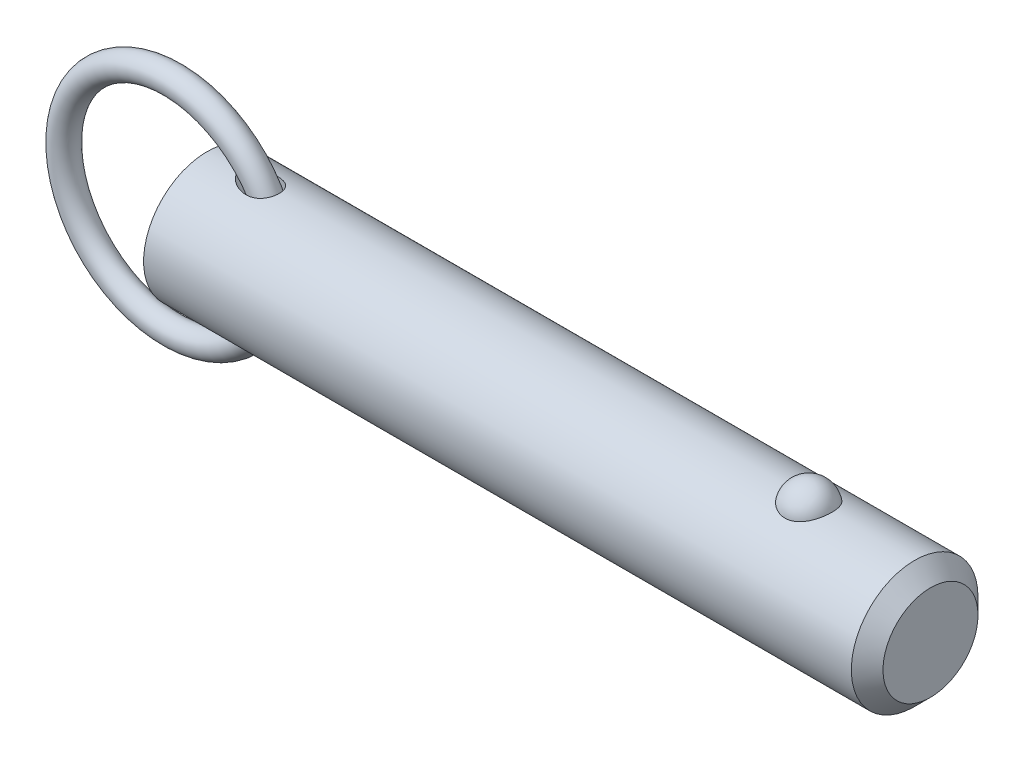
ISO-10303-21;
HEADER;
FILE_DESCRIPTION(('STEP AP214'),'2;1');
FILE_NAME('part.step','',(''),(''),'','','');
FILE_SCHEMA(('AUTOMOTIVE_DESIGN { 1 0 10303 214 1 1 1 1 }'));
ENDSEC;
DATA;
#1=APPLICATION_CONTEXT('core data for automotive mechanical design processes');
#2=APPLICATION_PROTOCOL_DEFINITION('international standard','automotive_design',2000,#1);
#3=PRODUCT_CONTEXT('',#1,'mechanical');
#4=PRODUCT('Part','Part','',(#3));
#5=PRODUCT_RELATED_PRODUCT_CATEGORY('part','',(#4));
#6=PRODUCT_DEFINITION_FORMATION('','',#4);
#7=PRODUCT_DEFINITION_CONTEXT('part definition',#1,'design');
#8=PRODUCT_DEFINITION('design','',#6,#7);
#9=PRODUCT_DEFINITION_SHAPE('','',#8);
#10=(LENGTH_UNIT() NAMED_UNIT(*) SI_UNIT(.MILLI.,.METRE.));
#11=(NAMED_UNIT(*) PLANE_ANGLE_UNIT() SI_UNIT($,.RADIAN.));
#12=(NAMED_UNIT(*) SI_UNIT($,.STERADIAN.) SOLID_ANGLE_UNIT());
#13=UNCERTAINTY_MEASURE_WITH_UNIT(LENGTH_MEASURE(1.E-05),#10,'distance_accuracy_value','');
#14=(GEOMETRIC_REPRESENTATION_CONTEXT(3) GLOBAL_UNCERTAINTY_ASSIGNED_CONTEXT((#13)) GLOBAL_UNIT_ASSIGNED_CONTEXT((#10,
#11,#12)) REPRESENTATION_CONTEXT('',''));
#15=CARTESIAN_POINT('',(0.,0.,0.));
#16=DIRECTION('',(0.,0.,1.));
#17=DIRECTION('',(1.,0.,0.));
#18=AXIS2_PLACEMENT_3D('',#15,#16,#17);
#19=CARTESIAN_POINT('',(-6.08699288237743,0.,0.));
#20=DIRECTION('',(0.,0.,1.));
#21=DIRECTION('',(1.,0.,0.));
#22=AXIS2_PLACEMENT_3D('',#19,#20,#21);
#23=TOROIDAL_SURFACE('',#22,19.05,2.223);
#24=CARTESIAN_POINT('',(15.1860071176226,0.,0.));
#25=VERTEX_POINT('',#24);
#26=VERTEX_LOOP('',#25);
#27=FACE_BOUND('',#26,.T.);
#28=ADVANCED_FACE('P0_F12',(#27),#23,.T.);
#29=CLOSED_SHELL('',(#28));
#30=MANIFOLD_SOLID_BREP('P0_B1',#29);
#31=CARTESIAN_POINT('',(0.,0.,0.));
#32=DIRECTION('',(1.,0.,0.));
#33=DIRECTION('',(0.,0.,-1.));
#34=AXIS2_PLACEMENT_3D('',#31,#32,#33);
#35=CYLINDRICAL_SURFACE('',#34,11.115);
#36=CARTESIAN_POINT('',(6.414051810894,11.0227946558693,-1.42871369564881));
#37=CARTESIAN_POINT('',(6.49338916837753,11.0115377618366,-1.5155664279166));
#38=CARTESIAN_POINT('',(6.57765461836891,10.9998263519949,-1.59789397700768));
#39=CARTESIAN_POINT('',(6.75386647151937,10.9760304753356,-1.75391400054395));
#40=CARTESIAN_POINT('',(6.84582247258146,10.9639455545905,-1.82759540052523));
#41=CARTESIAN_POINT('',(7.03627827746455,10.9397989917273,-1.96698954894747));
#42=CARTESIAN_POINT('',(7.13480838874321,10.9277377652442,-2.03266078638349));
#43=CARTESIAN_POINT('',(7.33681032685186,10.9041015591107,-2.1558582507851));
#44=CARTESIAN_POINT('',(7.44028007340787,10.8925263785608,-2.21338786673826));
#45=CARTESIAN_POINT('',(7.64386117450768,10.8710104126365,-2.31666528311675));
#46=CARTESIAN_POINT('',(7.74368989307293,10.8610119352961,-2.36295942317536));
#47=CARTESIAN_POINT('',(7.94637195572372,10.8420168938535,-2.44863486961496));
#48=CARTESIAN_POINT('',(8.04922612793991,10.8330206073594,-2.48801426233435));
#49=CARTESIAN_POINT('',(8.36115573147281,10.807980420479,-2.59542730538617));
#50=CARTESIAN_POINT('',(8.57411849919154,10.7938278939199,-2.65299817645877));
#51=CARTESIAN_POINT('',(9.00825016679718,10.7725818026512,-2.73800108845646));
#52=CARTESIAN_POINT('',(9.22947335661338,10.7655491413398,-2.76517330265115));
#53=CARTESIAN_POINT('',(9.67368141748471,10.7605872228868,-2.78445308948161));
#54=CARTESIAN_POINT('',(9.89666486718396,10.7626512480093,-2.77658653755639));
#55=CARTESIAN_POINT('',(10.2950172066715,10.7754452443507,-2.72644436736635));
#56=CARTESIAN_POINT('',(10.4712789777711,10.7844280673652,-2.69109376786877));
#57=CARTESIAN_POINT('',(10.7292776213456,10.8024982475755,-2.61722365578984));
#58=CARTESIAN_POINT('',(10.8142337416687,10.8092901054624,-2.58911576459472));
#59=CARTESIAN_POINT('',(10.9813218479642,10.8242580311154,-2.52581287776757));
#60=CARTESIAN_POINT('',(11.0634550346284,10.8324335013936,-2.49062094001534));
#61=CARTESIAN_POINT('',(11.2247418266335,10.8500287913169,-2.41281958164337));
#62=CARTESIAN_POINT('',(11.3038694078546,10.8594572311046,-2.37015806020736));
#63=CARTESIAN_POINT('',(11.4576781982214,10.8792243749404,-2.27770403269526));
#64=CARTESIAN_POINT('',(11.5323615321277,10.8895626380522,-2.22791497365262));
#65=CARTESIAN_POINT('',(11.6765388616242,10.9108113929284,-2.12140590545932));
#66=CARTESIAN_POINT('',(11.7460329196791,10.9217218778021,-2.064685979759));
#67=CARTESIAN_POINT('',(11.8790597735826,10.9437207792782,-1.94471764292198));
#68=CARTESIAN_POINT('',(11.9425932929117,10.9548091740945,-1.88147002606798));
#69=CARTESIAN_POINT('',(12.109388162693,10.9851999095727,-1.69784918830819));
#70=CARTESIAN_POINT('',(12.205655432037,11.0042655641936,-1.57093023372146));
#71=CARTESIAN_POINT('',(12.374151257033,11.0393391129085,-1.3017676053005));
#72=CARTESIAN_POINT('',(12.4463875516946,11.0553479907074,-1.15952888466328));
#73=CARTESIAN_POINT('',(12.5615818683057,11.0816338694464,-0.871972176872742));
#74=CARTESIAN_POINT('',(12.6058896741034,11.0921698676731,-0.72721773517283));
#75=CARTESIAN_POINT('',(12.6699315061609,11.1075802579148,-0.432089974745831));
#76=CARTESIAN_POINT('',(12.6896681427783,11.1124552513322,-0.281717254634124));
#77=CARTESIAN_POINT('',(12.704022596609,11.1159901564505,0.0188164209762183));
#78=CARTESIAN_POINT('',(12.6988836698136,11.1147102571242,0.16896512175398));
#79=CARTESIAN_POINT('',(12.6641681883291,11.1062126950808,0.466238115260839));
#80=CARTESIAN_POINT('',(12.6345920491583,11.0989951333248,0.613362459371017));
#81=CARTESIAN_POINT('',(12.5517453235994,11.0794095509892,0.900330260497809));
#82=CARTESIAN_POINT('',(12.4984878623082,11.0670443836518,1.04017770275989));
#83=CARTESIAN_POINT('',(12.3696588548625,11.0385082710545,1.308745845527));
#84=CARTESIAN_POINT('',(12.2940887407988,11.0223375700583,1.43746725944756));
#85=CARTESIAN_POINT('',(12.122380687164,10.987872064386,1.68079704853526));
#86=CARTESIAN_POINT('',(12.0261637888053,10.969569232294,1.79534850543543));
#87=CARTESIAN_POINT('',(11.8161707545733,10.932836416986,2.00695695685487));
#88=CARTESIAN_POINT('',(11.7023941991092,10.9144064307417,2.10401353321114));
#89=CARTESIAN_POINT('',(11.4575656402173,10.8788057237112,2.28105326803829));
#90=CARTESIAN_POINT('',(11.3261451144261,10.8616794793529,2.36053412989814));
#91=CARTESIAN_POINT('',(11.0523589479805,10.8308019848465,2.49839044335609));
#92=CARTESIAN_POINT('',(10.9099908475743,10.8170514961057,2.55676113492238));
#93=CARTESIAN_POINT('',(10.6060622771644,10.7929728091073,2.65666105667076));
#94=CARTESIAN_POINT('',(10.4438877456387,10.7830209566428,2.69640163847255));
#95=CARTESIAN_POINT('',(10.1154037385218,10.7687230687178,2.75293129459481));
#96=CARTESIAN_POINT('',(9.94909141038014,10.7643810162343,2.76970406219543));
#97=CARTESIAN_POINT('',(9.54387061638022,10.7604809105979,2.7848723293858));
#98=CARTESIAN_POINT('',(9.30446860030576,10.7637793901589,2.7722775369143));
#99=CARTESIAN_POINT('',(8.94961255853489,10.7757341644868,2.72524141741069));
#100=CARTESIAN_POINT('',(8.83186896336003,10.7808994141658,2.70482239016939));
#101=CARTESIAN_POINT('',(8.59835142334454,10.7932548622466,2.6550999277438));
#102=CARTESIAN_POINT('',(8.48257728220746,10.8004448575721,2.62579738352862));
#103=CARTESIAN_POINT('',(8.25208469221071,10.8166382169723,2.55827624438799));
#104=CARTESIAN_POINT('',(8.13740214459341,10.8256649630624,2.51994155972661));
#105=CARTESIAN_POINT('',(7.91132058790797,10.8451170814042,2.43486475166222));
#106=CARTESIAN_POINT('',(7.79992154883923,10.8555424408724,2.38812270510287));
#107=CARTESIAN_POINT('',(7.58115677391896,10.8774251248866,2.28638483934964));
#108=CARTESIAN_POINT('',(7.47378802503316,10.8888816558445,2.23139534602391));
#109=CARTESIAN_POINT('',(7.26385624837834,10.9124540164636,2.1131026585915));
#110=CARTESIAN_POINT('',(7.16129168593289,10.9245696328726,2.04980214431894));
#111=CARTESIAN_POINT('',(6.91882218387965,10.9543689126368,1.88540538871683));
#112=CARTESIAN_POINT('',(6.78193778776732,10.9721958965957,1.77979827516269));
#113=CARTESIAN_POINT('',(6.52472441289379,11.0070222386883,1.54989693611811));
#114=CARTESIAN_POINT('',(6.40436902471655,11.0240228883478,1.42563320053));
#115=CARTESIAN_POINT('',(6.21838804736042,11.0509658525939,1.19529359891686));
#116=CARTESIAN_POINT('',(6.14691885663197,11.0615430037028,1.09404520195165));
#117=CARTESIAN_POINT('',(6.02043496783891,11.0805004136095,0.881508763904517));
#118=CARTESIAN_POINT('',(5.96539400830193,11.0888841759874,0.770237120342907));
#119=CARTESIAN_POINT('',(5.88475453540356,11.1012553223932,0.560577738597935));
#120=CARTESIAN_POINT('',(5.85559643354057,11.1057686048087,0.463603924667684));
#121=CARTESIAN_POINT('',(5.81381299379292,11.1122523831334,0.266083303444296));
#122=CARTESIAN_POINT('',(5.80117118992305,11.1142254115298,0.165540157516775));
#123=CARTESIAN_POINT('',(5.79363815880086,11.1153999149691,-0.0364747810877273));
#124=CARTESIAN_POINT('',(5.79878799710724,11.1145949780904,-0.137948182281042));
#125=CARTESIAN_POINT('',(5.82639592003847,11.1102987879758,-0.338493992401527));
#126=CARTESIAN_POINT('',(5.84887234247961,11.1068046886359,-0.437563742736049));
#127=CARTESIAN_POINT('',(5.91510741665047,11.0965857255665,-0.649968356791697));
#128=CARTESIAN_POINT('',(5.96220905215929,11.0893566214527,-0.762222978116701));
#129=CARTESIAN_POINT('',(6.0737844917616,11.072471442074,-0.977396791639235));
#130=CARTESIAN_POINT('',(6.13826787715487,11.0628140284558,-1.08031079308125));
#131=CARTESIAN_POINT('',(6.24101077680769,11.0477136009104,-1.2219580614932));
#132=CARTESIAN_POINT('',(6.27403486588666,11.042895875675,-1.26469183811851));
#133=CARTESIAN_POINT('',(6.34238022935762,11.0330152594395,-1.34817011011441));
#134=CARTESIAN_POINT('',(6.37769867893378,11.0279526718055,-1.38891694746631));
#135=CARTESIAN_POINT('',(6.414051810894,11.0227946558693,-1.42871369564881));
#136=B_SPLINE_CURVE_WITH_KNOTS('',3,(#36,#37,#38,#39,#40,#41,#42,#43,#44,#45,#46,#47,#48,#49,
#50,#51,#52,#53,#54,#55,#56,#57,#58,#59,#60,#61,#62,#63,#64,#65,#66,#67,#68,#69,#70,#71,#72,#73,
#74,#75,#76,#77,#78,#79,#80,#81,#82,#83,#84,#85,#86,#87,#88,#89,#90,#91,#92,#93,#94,#95,#96,#97,
#98,#99,#100,#101,#102,#103,#104,#105,#106,#107,#108,#109,#110,#111,#112,#113,#114,#115,#116,
#117,#118,#119,#120,#121,#122,#123,#124,#125,#126,#127,#128,#129,#130,#131,#132,#133,#134,#135),
.UNSPECIFIED.,.T.,.F.,(4,2,2,2,2,2,2,2,2,2,2,2,2,2,2,2,2,2,2,2,2,2,2,2,2,2,2,2,2,2,2,2,2,2,2,2,
2,2,2,2,2,2,2,2,2,2,2,2,2,4),(0.,0.354433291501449,0.709315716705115,1.0659654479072,
1.42246628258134,1.75367157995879,2.08496839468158,2.74582009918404,3.41227815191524,
4.07824412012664,4.61583787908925,4.88478112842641,5.15360853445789,5.42439170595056,
5.6950443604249,5.96569375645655,6.23631025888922,6.7149072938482,7.1933500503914,
7.6464143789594,8.09943057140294,8.54802575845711,8.99661331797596,9.44495256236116,
9.89326303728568,10.3433195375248,10.7933867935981,11.2550086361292,11.7167345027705,
12.2165866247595,12.7167934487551,13.4318876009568,13.7904664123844,14.1490092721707,
14.5124394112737,14.8758662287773,15.239015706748,15.6020483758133,16.1219860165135,
16.6410830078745,17.0130520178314,17.3844231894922,17.6872330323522,17.9897407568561,
18.2929471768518,18.5964749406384,18.9603532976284,19.3244326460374,19.4870338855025,
19.649438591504),.UNSPECIFIED.);
#137=CARTESIAN_POINT('',(6.414051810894,11.0227946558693,-1.42871369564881));
#138=VERTEX_POINT('',#137);
#139=EDGE_CURVE('P1_E40',#138,#138,#136,.T.);
#140=ORIENTED_EDGE('',*,*,#139,.T.);
#141=EDGE_LOOP('',(#140));
#142=FACE_BOUND('',#141,.T.);
#143=CARTESIAN_POINT('',(124.22125,0.,0.));
#144=DIRECTION('',(1.,0.,0.));
#145=DIRECTION('',(0.,0.,-1.));
#146=AXIS2_PLACEMENT_3D('',#143,#144,#145);
#147=CIRCLE('',#146,11.115);
#148=CARTESIAN_POINT('',(124.22125,0.,-11.115));
#149=VERTEX_POINT('',#148);
#150=EDGE_CURVE('P1_E25',#149,#149,#147,.T.);
#151=ORIENTED_EDGE('',*,*,#150,.F.);
#152=EDGE_LOOP('',(#151));
#153=FACE_BOUND('',#152,.T.);
#154=CARTESIAN_POINT('',(0.,0.,0.));
#155=DIRECTION('',(1.,0.,0.));
#156=DIRECTION('',(0.,0.,-1.));
#157=AXIS2_PLACEMENT_3D('',#154,#155,#156);
#158=CIRCLE('',#157,11.115);
#159=CARTESIAN_POINT('',(0.,0.,-11.115));
#160=VERTEX_POINT('',#159);
#161=EDGE_CURVE('P1_E9',#160,#160,#158,.T.);
#162=ORIENTED_EDGE('',*,*,#161,.T.);
#163=EDGE_LOOP('',(#162));
#164=FACE_BOUND('',#163,.T.);
#165=CARTESIAN_POINT('',(105.631068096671,10.3028087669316,4.17077409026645));
#166=CARTESIAN_POINT('',(105.414775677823,10.3028003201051,4.17078240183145));
#167=CARTESIAN_POINT('',(105.198548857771,10.3098895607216,4.15340593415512));
#168=CARTESIAN_POINT('',(104.772540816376,10.3373834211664,4.08449540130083));
#169=CARTESIAN_POINT('',(104.562757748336,10.3577841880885,4.03297121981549));
#170=CARTESIAN_POINT('',(104.155782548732,10.4095237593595,3.89746513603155));
#171=CARTESIAN_POINT('',(103.958572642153,10.4408466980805,3.81353029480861));
#172=CARTESIAN_POINT('',(103.581338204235,10.5110236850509,3.61560339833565));
#173=CARTESIAN_POINT('',(103.401317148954,10.5498792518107,3.50160528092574));
#174=CARTESIAN_POINT('',(103.057684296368,10.6322884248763,3.24292464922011));
#175=CARTESIAN_POINT('',(102.894686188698,10.6759443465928,3.09746040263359));
#176=CARTESIAN_POINT('',(102.594591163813,10.7625291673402,2.78171925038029));
#177=CARTESIAN_POINT('',(102.457499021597,10.8054579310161,2.61143778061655));
#178=CARTESIAN_POINT('',(102.206408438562,10.8881935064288,2.24226695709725));
#179=CARTESIAN_POINT('',(102.093710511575,10.9277761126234,2.04244123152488));
#180=CARTESIAN_POINT('',(101.901777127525,10.997484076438,1.62578254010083));
#181=CARTESIAN_POINT('',(101.822544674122,11.0276085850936,1.40894804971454));
#182=CARTESIAN_POINT('',(101.698303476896,11.0756732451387,0.961250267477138));
#183=CARTESIAN_POINT('',(101.653760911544,11.0934470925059,0.730239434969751));
#184=CARTESIAN_POINT('',(101.601569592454,11.1143331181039,0.263439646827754));
#185=CARTESIAN_POINT('',(101.593920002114,11.1174456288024,0.0276507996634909));
#186=CARTESIAN_POINT('',(101.61561056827,11.1087161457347,-0.440729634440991));
#187=CARTESIAN_POINT('',(101.644762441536,11.0969502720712,-0.673331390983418));
#188=CARTESIAN_POINT('',(101.739143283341,11.0597872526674,-1.12996621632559));
#189=CARTESIAN_POINT('',(101.804372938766,11.0343898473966,-1.35399912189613));
#190=CARTESIAN_POINT('',(101.96969844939,10.972515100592,-1.78750286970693));
#191=CARTESIAN_POINT('',(102.06983863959,10.9360236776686,-1.99695478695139));
#192=CARTESIAN_POINT('',(102.302940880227,10.8557595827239,-2.3952066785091));
#193=CARTESIAN_POINT('',(102.435905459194,10.8119863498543,-2.5840050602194));
#194=CARTESIAN_POINT('',(102.732407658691,10.7216733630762,-2.93635726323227));
#195=CARTESIAN_POINT('',(102.896056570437,10.675123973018,-3.09981510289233));
#196=CARTESIAN_POINT('',(103.249860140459,10.5846571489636,-3.39592247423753));
#197=CARTESIAN_POINT('',(103.440012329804,10.5407394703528,-3.52857487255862));
#198=CARTESIAN_POINT('',(103.83750141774,10.4616690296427,-3.75646057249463));
#199=CARTESIAN_POINT('',(104.04436705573,10.4263443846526,-3.85245432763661));
#200=CARTESIAN_POINT('',(104.472954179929,10.3675574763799,-4.00798747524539));
#201=CARTESIAN_POINT('',(104.694670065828,10.3440907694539,-4.06754052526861));
#202=CARTESIAN_POINT('',(105.134669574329,10.3128282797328,-4.14614314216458));
#203=CARTESIAN_POINT('',(105.352565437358,10.3043040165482,-4.1670783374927));
#204=CARTESIAN_POINT('',(105.78894951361,10.3016771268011,-4.17357158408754));
#205=CARTESIAN_POINT('',(106.007437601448,10.3075716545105,-4.15913661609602));
#206=CARTESIAN_POINT('',(106.431744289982,10.3326686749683,-4.09636961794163));
#207=CARTESIAN_POINT('',(106.637745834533,10.3514555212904,-4.0490957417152));
#208=CARTESIAN_POINT('',(107.038576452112,10.399818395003,-3.92320197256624));
#209=CARTESIAN_POINT('',(107.2334046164,10.4293952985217,-3.84457953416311));
#210=CARTESIAN_POINT('',(107.611191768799,10.4969600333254,-3.65612410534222));
#211=CARTESIAN_POINT('',(107.793797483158,10.5351178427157,-3.54564545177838));
#212=CARTESIAN_POINT('',(108.138204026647,10.6154999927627,-3.29718036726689));
#213=CARTESIAN_POINT('',(108.300000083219,10.657725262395,-3.15918764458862));
#214=CARTESIAN_POINT('',(108.606959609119,10.744212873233,-2.85163580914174));
#215=CARTESIAN_POINT('',(108.750891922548,10.7884718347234,-2.68084605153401));
#216=CARTESIAN_POINT('',(109.009237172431,10.872374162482,-2.31721864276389));
#217=CARTESIAN_POINT('',(109.123644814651,10.9120167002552,-2.12437704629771));
#218=CARTESIAN_POINT('',(109.323873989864,10.9838919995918,-1.71516999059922));
#219=CARTESIAN_POINT('',(109.40866178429,11.0158465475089,-1.498248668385));
#220=CARTESIAN_POINT('',(109.54268382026,11.0673523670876,-1.052285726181));
#221=CARTESIAN_POINT('',(109.591917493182,11.086903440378,-0.823243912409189));
#222=CARTESIAN_POINT('',(109.653891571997,11.1116323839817,-0.359087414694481));
#223=CARTESIAN_POINT('',(109.666566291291,11.1167843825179,-0.123962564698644));
#224=CARTESIAN_POINT('',(109.654973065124,11.1121144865,0.345220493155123));
#225=CARTESIAN_POINT('',(109.630705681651,11.1022928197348,0.579278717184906));
#226=CARTESIAN_POINT('',(109.545907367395,11.0687504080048,1.03866534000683));
#227=CARTESIAN_POINT('',(109.485529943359,11.0450885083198,1.26402641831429));
#228=CARTESIAN_POINT('',(109.329853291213,10.9863185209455,1.70076772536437));
#229=CARTESIAN_POINT('',(109.234551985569,10.9512097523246,1.91214712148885));
#230=CARTESIAN_POINT('',(109.010397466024,10.8729733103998,2.31608359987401));
#231=CARTESIAN_POINT('',(108.881380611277,10.8298068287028,2.50854240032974));
#232=CARTESIAN_POINT('',(108.592732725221,10.7401896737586,2.86808766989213));
#233=CARTESIAN_POINT('',(108.433102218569,10.6937390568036,3.03517457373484));
#234=CARTESIAN_POINT('',(108.087534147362,10.6029321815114,3.33857581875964));
#235=CARTESIAN_POINT('',(107.901708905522,10.5585680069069,3.47501541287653));
#236=CARTESIAN_POINT('',(107.507875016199,10.4769321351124,3.71390897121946));
#237=CARTESIAN_POINT('',(107.299863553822,10.439661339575,3.81635861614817));
#238=CARTESIAN_POINT('',(106.854066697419,10.3749407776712,3.98910631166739));
#239=CARTESIAN_POINT('',(106.615234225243,10.3482457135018,4.05700929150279));
#240=CARTESIAN_POINT('',(106.127925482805,10.312188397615,4.14782844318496));
#241=CARTESIAN_POINT('',(105.879453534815,10.3028184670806,4.17076454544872));
#242=CARTESIAN_POINT('',(105.631068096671,10.3028087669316,4.17077409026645));
#243=B_SPLINE_CURVE_WITH_KNOTS('',3,(#165,#166,#167,#168,#169,#170,#171,#172,#173,#174,#175,
#176,#177,#178,#179,#180,#181,#182,#183,#184,#185,#186,#187,#188,#189,#190,#191,#192,#193,#194,
#195,#196,#197,#198,#199,#200,#201,#202,#203,#204,#205,#206,#207,#208,#209,#210,#211,#212,#213,
#214,#215,#216,#217,#218,#219,#220,#221,#222,#223,#224,#225,#226,#227,#228,#229,#230,#231,#232,
#233,#234,#235,#236,#237,#238,#239,#240,#241,#242),.UNSPECIFIED.,.T.,.F.,(4,2,2,2,2,2,2,2,2,2,2,
2,2,2,2,2,2,2,2,2,2,2,2,2,2,2,2,2,2,2,2,2,2,2,2,2,2,2,4),(0.,0.647966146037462,1.29574482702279,
1.94258643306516,2.58955857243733,3.25496465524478,3.92049326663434,4.61566368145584,
5.31089647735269,6.01531821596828,6.71972398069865,7.42054043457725,8.12137023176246,
8.82309331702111,9.52487047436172,10.2292439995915,10.9335519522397,11.6223330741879,
12.3108558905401,12.9647664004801,13.6185478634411,14.2521847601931,14.8858731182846,
15.5334360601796,16.1811472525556,16.8611459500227,17.5412664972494,18.2431855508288,
18.9451158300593,19.6483065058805,20.3514864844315,21.0516982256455,21.7519516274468,
22.4556690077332,23.1593743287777,23.8601491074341,24.5610129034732,25.3054529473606,
26.049562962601),.UNSPECIFIED.);
#244=CARTESIAN_POINT('',(105.631068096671,10.3028087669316,4.17077409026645));
#245=VERTEX_POINT('',#244);
#246=EDGE_CURVE('P1_E34',#245,#245,#243,.T.);
#247=ORIENTED_EDGE('',*,*,#246,.T.);
#248=EDGE_LOOP('',(#247));
#249=FACE_BOUND('',#248,.T.);
#250=CARTESIAN_POINT('',(6.414051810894,-11.0227946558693,-1.42871369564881));
#251=CARTESIAN_POINT('',(6.3312406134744,-11.0345445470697,-1.33806125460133));
#252=CARTESIAN_POINT('',(6.25372866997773,-11.0458090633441,-1.24240732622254));
#253=CARTESIAN_POINT('',(6.11277905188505,-11.0666115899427,-1.04095704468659));
#254=CARTESIAN_POINT('',(6.04933920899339,-11.0761498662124,-0.935162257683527));
#255=CARTESIAN_POINT('',(5.94029181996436,-11.0927063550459,-0.712476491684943));
#256=CARTESIAN_POINT('',(5.89492964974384,-11.0996897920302,-0.595457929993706));
#257=CARTESIAN_POINT('',(5.8449816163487,-11.1074141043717,-0.414997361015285));
#258=CARTESIAN_POINT('',(5.83135004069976,-11.1095300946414,-0.354047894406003));
#259=CARTESIAN_POINT('',(5.81051649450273,-11.1127688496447,-0.23104152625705));
#260=CARTESIAN_POINT('',(5.80331311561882,-11.1138918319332,-0.168984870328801));
#261=CARTESIAN_POINT('',(5.7929652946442,-11.1155042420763,-0.000484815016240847));
#262=CARTESIAN_POINT('',(5.79625267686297,-11.1149904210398,0.106437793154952));
#263=CARTESIAN_POINT('',(5.82213676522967,-11.1109609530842,0.317809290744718));
#264=CARTESIAN_POINT('',(5.84474662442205,-11.1074432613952,0.422256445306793));
#265=CARTESIAN_POINT('',(5.91113114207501,-11.097197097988,0.639361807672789));
#266=CARTESIAN_POINT('',(5.95733120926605,-11.090102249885,0.751250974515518));
#267=CARTESIAN_POINT('',(6.06709542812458,-11.0734770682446,0.965912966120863));
#268=CARTESIAN_POINT('',(6.13068735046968,-11.06394284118,1.06867085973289));
#269=CARTESIAN_POINT('',(6.30294237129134,-11.0385920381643,1.30890635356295));
#270=CARTESIAN_POINT('',(6.41896200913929,-11.0218881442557,1.44097376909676));
#271=CARTESIAN_POINT('',(6.66989654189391,-10.9871512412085,1.68553954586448));
#272=CARTESIAN_POINT('',(6.80485520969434,-10.9691152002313,1.79799117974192));
#273=CARTESIAN_POINT('',(7.04881236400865,-10.9382283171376,1.97587596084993));
#274=CARTESIAN_POINT('',(7.15465712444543,-10.9253240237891,2.04570822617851));
#275=CARTESIAN_POINT('',(7.37202504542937,-10.9000987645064,2.17611840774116));
#276=CARTESIAN_POINT('',(7.48355057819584,-10.8877780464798,2.23669241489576));
#277=CARTESIAN_POINT('',(7.71132418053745,-10.8641580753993,2.34873831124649));
#278=CARTESIAN_POINT('',(7.82757727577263,-10.8528599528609,2.40020018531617));
#279=CARTESIAN_POINT('',(8.06386825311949,-10.8317234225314,2.49385169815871));
#280=CARTESIAN_POINT('',(8.18390558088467,-10.8218848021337,2.53604268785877));
#281=CARTESIAN_POINT('',(8.42918336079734,-10.8039208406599,2.61152283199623));
#282=CARTESIAN_POINT('',(8.55447802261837,-10.7958283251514,2.64464414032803));
#283=CARTESIAN_POINT('',(8.8075212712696,-10.781995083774,2.70048793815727));
#284=CARTESIAN_POINT('',(8.93527019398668,-10.7762546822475,2.72320899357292));
#285=CARTESIAN_POINT('',(9.19210176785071,-10.7675291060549,2.75750994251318));
#286=CARTESIAN_POINT('',(9.32118105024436,-10.7645381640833,2.76911315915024));
#287=CARTESIAN_POINT('',(9.57984338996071,-10.761622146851,2.78042035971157));
#288=CARTESIAN_POINT('',(9.70942621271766,-10.7616957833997,2.78012934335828));
#289=CARTESIAN_POINT('',(10.0243125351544,-10.7659059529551,2.76381534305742));
#290=CARTESIAN_POINT('',(10.209307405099,-10.7717977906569,2.74099674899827));
#291=CARTESIAN_POINT('',(10.5731188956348,-10.7905408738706,2.66626238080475));
#292=CARTESIAN_POINT('',(10.7519389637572,-10.8033881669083,2.61436313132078));
#293=CARTESIAN_POINT('',(11.0114289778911,-10.8271584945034,2.51336808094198));
#294=CARTESIAN_POINT('',(11.096831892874,-10.835881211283,2.47562331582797));
#295=CARTESIAN_POINT('',(11.2636000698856,-10.8545688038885,2.39236170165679));
#296=CARTESIAN_POINT('',(11.3449673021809,-10.8645330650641,2.3468486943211));
#297=CARTESIAN_POINT('',(11.5027832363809,-10.8853818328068,2.24815967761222));
#298=CARTESIAN_POINT('',(11.5792327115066,-10.8962661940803,2.19498487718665));
#299=CARTESIAN_POINT('',(11.7263315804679,-10.9185541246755,2.08128855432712));
#300=CARTESIAN_POINT('',(11.7969818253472,-10.9299576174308,2.02076811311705));
#301=CARTESIAN_POINT('',(11.9817953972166,-10.9613645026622,1.84513663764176));
#302=CARTESIAN_POINT('',(12.0893012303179,-10.9814643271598,1.72286660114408));
#303=CARTESIAN_POINT('',(12.2803576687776,-11.0193991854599,1.46066991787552));
#304=CARTESIAN_POINT('',(12.3639173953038,-11.0372350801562,1.3207500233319));
#305=CARTESIAN_POINT('',(12.4996220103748,-11.0672969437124,1.03778067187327));
#306=CARTESIAN_POINT('',(12.5535315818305,-11.0798242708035,0.895607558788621));
#307=CARTESIAN_POINT('',(12.636874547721,-11.0995427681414,0.603918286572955));
#308=CARTESIAN_POINT('',(12.6663115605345,-11.1067347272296,0.454403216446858));
#309=CARTESIAN_POINT('',(12.6997387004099,-11.1149224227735,0.154577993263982));
#310=CARTESIAN_POINT('',(12.7040886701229,-11.1160057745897,0.00431019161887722));
#311=CARTESIAN_POINT('',(12.6882048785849,-11.1120956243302,-0.29484108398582));
#312=CARTESIAN_POINT('',(12.6679715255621,-11.1071022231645,-0.443724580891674));
#313=CARTESIAN_POINT('',(12.6034470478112,-11.0915888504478,-0.735688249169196));
#314=CARTESIAN_POINT('',(12.5591858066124,-11.0810757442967,-0.878775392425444));
#315=CARTESIAN_POINT('',(12.4477416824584,-11.0556687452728,-1.15529525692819));
#316=CARTESIAN_POINT('',(12.3805601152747,-11.0407751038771,-1.2887285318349));
#317=CARTESIAN_POINT('',(12.2248919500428,-11.0081839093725,-1.54257976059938));
#318=CARTESIAN_POINT('',(12.1363549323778,-10.9904797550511,-1.66296592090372));
#319=CARTESIAN_POINT('',(11.9406137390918,-10.9541951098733,-1.88726577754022));
#320=CARTESIAN_POINT('',(11.833409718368,-10.9356146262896,-1.99117961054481));
#321=CARTESIAN_POINT('',(11.601318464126,-10.8991360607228,-2.18213646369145));
#322=CARTESIAN_POINT('',(11.4761325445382,-10.8812577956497,-2.26881927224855));
#323=CARTESIAN_POINT('',(11.2134852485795,-10.8482871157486,-2.42157282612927));
#324=CARTESIAN_POINT('',(11.0760218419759,-10.8331951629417,-2.48764015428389));
#325=CARTESIAN_POINT('',(10.7828968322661,-10.8061050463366,-2.60290068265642));
#326=CARTESIAN_POINT('',(10.6266338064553,-10.7943907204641,-2.65062248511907));
#327=CARTESIAN_POINT('',(10.3086617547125,-10.7762429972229,-2.72345054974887));
#328=CARTESIAN_POINT('',(10.146948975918,-10.7698133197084,-2.74854088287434));
#329=CARTESIAN_POINT('',(9.75541304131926,-10.7608036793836,-2.78368719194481));
#330=CARTESIAN_POINT('',(9.52459435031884,-10.7608467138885,-2.78350276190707));
#331=CARTESIAN_POINT('',(9.06604960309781,-10.7702674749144,-2.74677945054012));
#332=CARTESIAN_POINT('',(8.83832966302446,-10.7796615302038,-2.71017697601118));
#333=CARTESIAN_POINT('',(8.38783466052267,-10.8058248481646,-2.60392490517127));
#334=CARTESIAN_POINT('',(8.1651710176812,-10.8226939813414,-2.53382676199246));
#335=CARTESIAN_POINT('',(7.84087311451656,-10.8516548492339,-2.40555545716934));
#336=CARTESIAN_POINT('',(7.73435551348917,-10.8619221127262,-2.35892455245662));
#337=CARTESIAN_POINT('',(7.52510420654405,-10.883357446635,-2.25797017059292));
#338=CARTESIAN_POINT('',(7.4223698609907,-10.8945253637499,-2.20364800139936));
#339=CARTESIAN_POINT('',(7.23808758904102,-10.915528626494,-2.09688018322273));
#340=CARTESIAN_POINT('',(7.15584631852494,-10.9252787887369,-2.0456107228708));
#341=CARTESIAN_POINT('',(6.99510576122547,-10.944960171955,-1.93754729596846));
#342=CARTESIAN_POINT('',(6.91660574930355,-10.9548913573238,-1.88075440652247));
#343=CARTESIAN_POINT('',(6.76418133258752,-10.974690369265,-1.76154504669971));
#344=CARTESIAN_POINT('',(6.69024940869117,-10.9845582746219,-1.6991382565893));
#345=CARTESIAN_POINT('',(6.54780119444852,-11.0039826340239,-1.56842485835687));
#346=CARTESIAN_POINT('',(6.47928247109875,-11.0135392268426,-1.50012092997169));
#347=CARTESIAN_POINT('',(6.414051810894,-11.0227946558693,-1.42871369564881));
#348=B_SPLINE_CURVE_WITH_KNOTS('',3,(#250,#251,#252,#253,#254,#255,#256,#257,#258,#259,#260,
#261,#262,#263,#264,#265,#266,#267,#268,#269,#270,#271,#272,#273,#274,#275,#276,#277,#278,#279,
#280,#281,#282,#283,#284,#285,#286,#287,#288,#289,#290,#291,#292,#293,#294,#295,#296,#297,#298,
#299,#300,#301,#302,#303,#304,#305,#306,#307,#308,#309,#310,#311,#312,#313,#314,#315,#316,#317,
#318,#319,#320,#321,#322,#323,#324,#325,#326,#327,#328,#329,#330,#331,#332,#333,#334,#335,#336,
#337,#338,#339,#340,#341,#342,#343,#344,#345,#346,#347),.UNSPECIFIED.,.T.,.F.,(4,2,2,2,2,2,2,2,
2,2,2,2,2,2,2,2,2,2,2,2,2,2,2,2,2,2,2,2,2,2,2,2,2,2,2,2,2,2,2,2,2,2,2,2,2,2,2,2,4),(0.,
0.369835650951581,0.739614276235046,1.1142538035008,1.30141910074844,1.48854338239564,
1.8074587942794,2.12659146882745,2.4883888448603,2.85076733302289,3.3776216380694,
3.90571433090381,4.287639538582,4.66972556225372,5.05222896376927,5.43467659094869,
5.82378546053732,6.21294796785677,6.60129228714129,6.9894733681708,7.54669558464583,
8.10360148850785,8.38458539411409,8.66543074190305,8.94623182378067,9.22699162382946,
9.7162888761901,10.2053995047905,10.6608871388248,11.1163074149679,11.5651786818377,
12.0140424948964,12.4623493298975,12.9106304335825,13.3599804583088,13.8093267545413,
14.2672570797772,14.7252632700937,15.214740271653,15.7045615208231,16.3932594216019,
17.083162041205,17.7825738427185,18.1325177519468,18.4824022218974,18.7744056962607,
19.0663523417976,19.3578048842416,19.6491256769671),.UNSPECIFIED.);
#349=CARTESIAN_POINT('',(6.414051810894,-11.0227946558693,-1.42871369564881));
#350=VERTEX_POINT('',#349);
#351=EDGE_CURVE('P1_E17',#350,#350,#348,.T.);
#352=ORIENTED_EDGE('',*,*,#351,.T.);
#353=EDGE_LOOP('',(#352));
#354=FACE_BOUND('',#353,.T.);
#355=ADVANCED_FACE('P1_F13',(#142,#153,#164,#249,#354),#35,.T.);
#356=CARTESIAN_POINT('',(0.,0.,0.));
#357=DIRECTION('',(-1.,0.,0.));
#358=DIRECTION('',(0.,0.,1.));
#359=AXIS2_PLACEMENT_3D('',#356,#357,#358);
#360=PLANE('',#359);
#361=ORIENTED_EDGE('',*,*,#161,.F.);
#362=EDGE_LOOP('',(#361));
#363=FACE_BOUND('',#362,.T.);
#364=ADVANCED_FACE('P1_F15',(#363),#360,.T.);
#365=CARTESIAN_POINT('',(127.,0.,0.));
#366=DIRECTION('',(-1.,0.,0.));
#367=DIRECTION('',(0.,0.,1.));
#368=AXIS2_PLACEMENT_3D('',#365,#366,#367);
#369=CONICAL_SURFACE('',#368,8.33625000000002,0.785398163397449);
#370=ORIENTED_EDGE('',*,*,#150,.T.);
#371=EDGE_LOOP('',(#370));
#372=FACE_BOUND('',#371,.T.);
#373=CARTESIAN_POINT('',(127.,0.,0.));
#374=DIRECTION('',(1.,0.,0.));
#375=DIRECTION('',(0.,0.,-1.));
#376=AXIS2_PLACEMENT_3D('',#373,#374,#375);
#377=CIRCLE('',#376,8.33625000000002);
#378=CARTESIAN_POINT('',(127.,0.,-8.33625000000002));
#379=VERTEX_POINT('',#378);
#380=EDGE_CURVE('P1_E30',#379,#379,#377,.T.);
#381=ORIENTED_EDGE('',*,*,#380,.F.);
#382=EDGE_LOOP('',(#381));
#383=FACE_BOUND('',#382,.T.);
#384=ADVANCED_FACE('P1_F55',(#372,#383),#369,.T.);
#385=CARTESIAN_POINT('',(127.,8.33625000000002,0.));
#386=DIRECTION('',(1.,0.,0.));
#387=DIRECTION('',(0.,0.,-1.));
#388=AXIS2_PLACEMENT_3D('',#385,#386,#387);
#389=PLANE('',#388);
#390=ORIENTED_EDGE('',*,*,#380,.T.);
#391=EDGE_LOOP('',(#390));
#392=FACE_BOUND('',#391,.T.);
#393=ADVANCED_FACE('P1_F51',(#392),#389,.T.);
#394=CARTESIAN_POINT('',(105.631068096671,10.0035,0.));
#395=DIRECTION('',(-1.,0.,0.));
#396=DIRECTION('',(0.,1.,0.));
#397=AXIS2_PLACEMENT_3D('',#394,#395,#396);
#398=SPHERICAL_SURFACE('',#397,4.18150000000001);
#399=ORIENTED_EDGE('',*,*,#246,.F.);
#400=EDGE_LOOP('',(#399));
#401=FACE_BOUND('',#400,.T.);
#402=ADVANCED_FACE('P1_F46',(#401),#398,.T.);
#403=CARTESIAN_POINT('',(-6.08699288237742,0.,0.));
#404=DIRECTION('',(0.,0.,1.));
#405=DIRECTION('',(1.,0.,0.));
#406=AXIS2_PLACEMENT_3D('',#403,#404,#405);
#407=TOROIDAL_SURFACE('',#406,19.05,2.77875);
#408=ORIENTED_EDGE('',*,*,#351,.F.);
#409=EDGE_LOOP('',(#408));
#410=FACE_BOUND('',#409,.T.);
#411=ORIENTED_EDGE('',*,*,#139,.F.);
#412=EDGE_LOOP('',(#411));
#413=FACE_BOUND('',#412,.T.);
#414=ADVANCED_FACE('P1_F50',(#410,#413),#407,.F.);
#415=CLOSED_SHELL('',(#355,#364,#384,#393,#402,#414));
#416=MANIFOLD_SOLID_BREP('P1_B1',#415);
#417=ADVANCED_BREP_SHAPE_REPRESENTATION('',(#18,#30,#416),#14);
#418=SHAPE_DEFINITION_REPRESENTATION(#9,#417);
ENDSEC;
END-ISO-10303-21;
